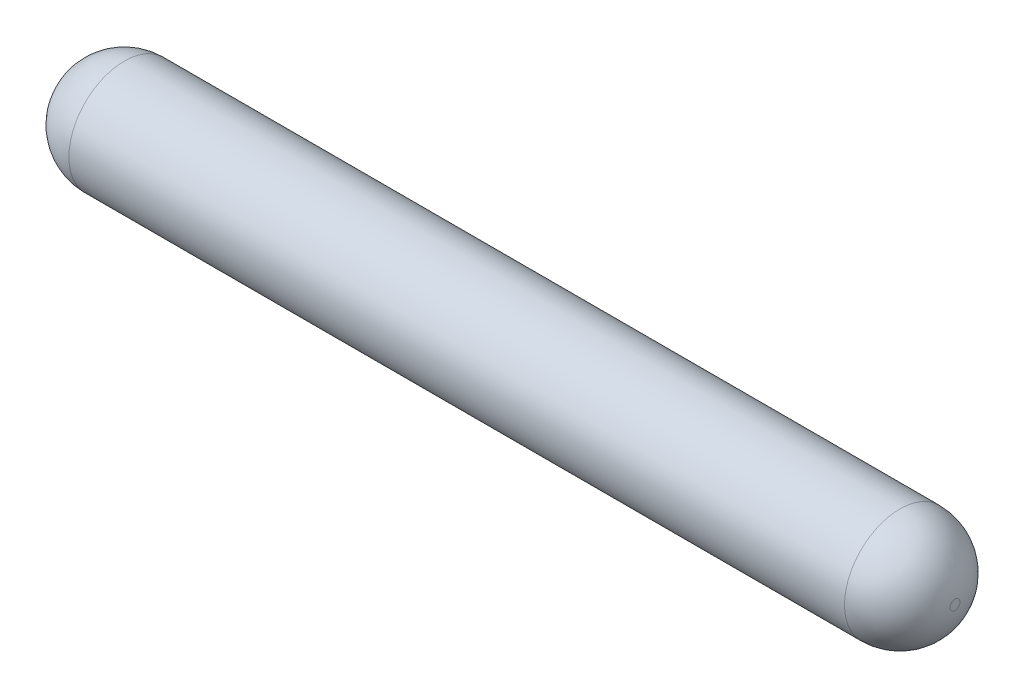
from build123d import *


with BuildPart() as part:
    # Sketch1 → Revolve1 (revolve)
    with BuildSketch(Plane(origin=(0, 0, 0), x_dir=(1, 0, 0), z_dir=(0, 1, 0)), mode=Mode.PRIVATE) as revolve1_sk:
        with BuildLine():
            Line((40, 0), (40, 0.223383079))
            ThreePointArc((40, 0.223383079), (39.19694136, 1.845055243), (37.51, 2.5))
            Line((37.51, 2.5), (2.5, 2.5))
            ThreePointArc((2.5, 2.5), (0.81305864, 1.845055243), (0.01, 0.223383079))
            Line((0.01, 0.223383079), (0.01, 0))
            Line((0.01, 0), (40, 0))
        make_face()
    revolve(revolve1_sk.sketch.rotate(Axis((0.01, 0, 0), (1, 0, 0)), 180), axis=Axis((0.01, 0, 0), (1, 0, 0)))


solid = part.part
